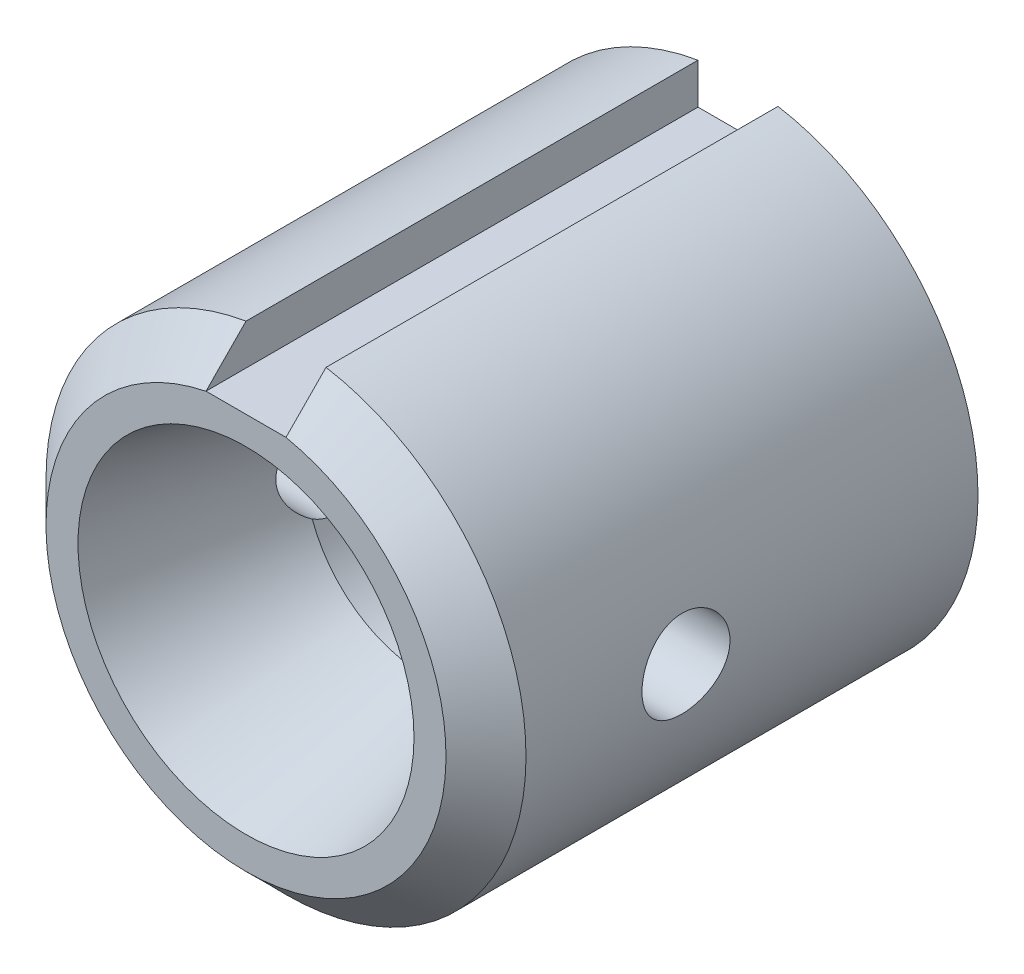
from build123d import *

# Parameters (mm, degrees)
SKETCH1_W      = 6
SKETCH1_H      = 12.3
EXTRUDE1_DEPTH = 309.396319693
HOLE1_D        = 6
CHAMFER1_SIZE  = 1
SKETCH5_R      = 1.1
EXTRUDE3_DEPTH = 80
SKETCH6_R      = 4.2
EXTRUDE4_DEPTH = 10
EXTRUDE4_DRAFT = -15


with BuildPart() as part:
    # Sketch1 → Revolve1 (revolve)
    with BuildSketch(Plane(origin=(0, 295, 0), x_dir=(-1, 0, 0), z_dir=(0, 1, 0))):
        with Locations((-63, 12.85)):
            Rectangle(SKETCH1_W, SKETCH1_H)
    revolve(axis=Axis((60, 295, 6.7), (0, 0, 1)))

    # Sketch2 → Extrude1 (cut, through all)
    with BuildSketch(Plane(origin=(0, 0, 6.7), x_dir=(-1, 0, 0), z_dir=(0, 0, -1))):
        with BuildLine():
            Line((-61, 300.916079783), (-61, 299.9))
            Line((-61, 299.9), (-59, 299.9))
            Line((-59, 299.9), (-59, 300.916079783))
            ThreePointArc((-59, 300.916079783), (-60, 301), (-61, 300.916079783))
        make_face()
    extrude(amount=-EXTRUDE1_DEPTH, mode=Mode.SUBTRACT)

    # Hole1 (through all)
    with Locations(Plane(origin=(0, 0, 6.7), x_dir=(-1, 0, 0), z_dir=(0, 0, -1))):
        with Locations((-60, 295)):
            Hole(HOLE1_D / 2)

    # Chamfer1
    chamfer1_edges = [part.edges().sort_by_distance(p)[0] for p in [
        (60, 289, 19),
    ]]
    chamfer(chamfer1_edges, length=CHAMFER1_SIZE)

    # Sketch5 → Extrude3 (cut)
    with BuildSketch(Plane(origin=(0, 0, 0), x_dir=(0, 0, -1), z_dir=(1, 0, 0))):
        with Locations(Location((-14, 294.95, 0), (0, 0, 180))):
            Circle(SKETCH5_R)
    extrude(amount=EXTRUDE3_DEPTH, mode=Mode.SUBTRACT)


with BuildPart() as extrude4_tool:
    # Sketch6 → Extrude4 (with draft: the straight prism first)
    with BuildSketch(Plane.XY.offset(19)):
        with Locations((60, 295)):
            Circle(SKETCH6_R)
    extrude(amount=-EXTRUDE4_DEPTH)
    # Extrude4: the draft: its side faces are tilted about the plane it starts from
    extrude4_sides = [extrude4_tool.faces().sort_by_distance(p)[0] for p in [
        (55.8, 295, 14),
    ]]
    draft(extrude4_sides, Plane.XY.offset(19), EXTRUDE4_DRAFT)


with BuildPart() as part_1:
    add(part.part)

    # Extrude4: cut by extrude4_tool
    add(extrude4_tool.part, mode=Mode.SUBTRACT)


solid = part_1.part
